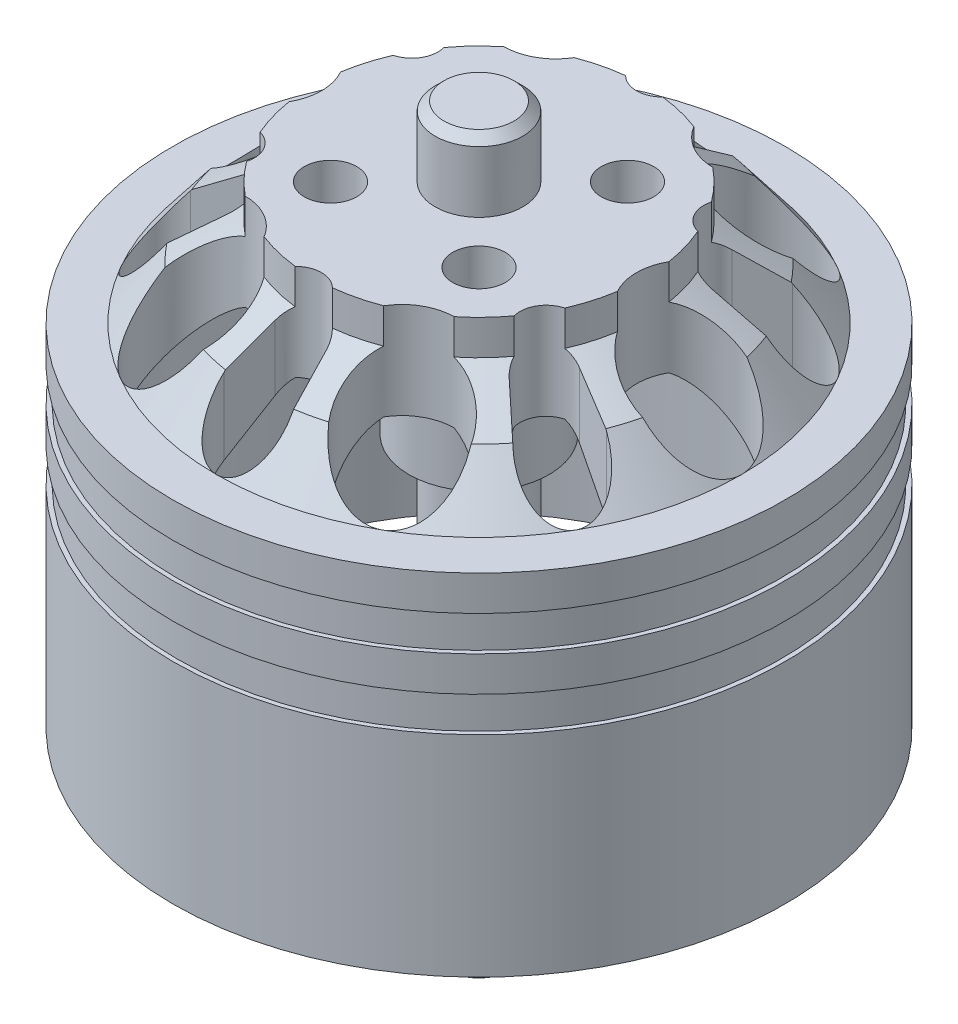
from build123d import *

# Parameters (mm, degrees)
SKETCH3_R          = 3
CUT_EXTRUDE1_DEPTH = 46.348649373
CIRPATTERN1_COUNT  = 6
CUT_EXTRUDE2_DEPTH = 46.348649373
CIRPATTERN2_COUNT  = 6
CHAMFER1_SIZE      = 0.5
SKETCH5_R          = 1.5
CUT_EXTRUDE3_DEPTH = 10


with BuildPart() as part:
    # Sketch1 → Revolve1 (revolve)
    with BuildSketch(Plane.XY, mode=Mode.PRIVATE) as revolve1_sk:
        Polygon((0, 0), (0, 42), (2.5, 42), (2.5, 38), (9.5, 38), (9.5, 36), (12.690817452, 33.984899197), (15, 31), (17.5, 31), (17.5, 29), (17.25, 29), (17.25, 27), (17.5, 27), (17.5, 25), (17.25, 25), (17.25, 23), (17.5, 23), (17.5, 11), (15, 11), (15, 28.5), (13.9, 28.5), (9.5, 32.5), (4, 32.5), (4, 25.5), (2.5, 25.5), (2.5, 0), align=None)
    revolve(revolve1_sk.sketch.rotate(Axis((0, 0, 0), (0, -1, 0)), 90), axis=Axis((0, 0, 0), (0, -1, 0)))

    # Sketch3 → Cut-Extrude1 (cut, through all)
    with BuildSketch(Plane(origin=(0, 38, 0), x_dir=(1, 0, 0), z_dir=(0, 1, 0))):
        with Locations(Location((12, 0, 0), (0, 0, 209.363334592))):
            Circle(SKETCH3_R)
    cut_extrude1 = extrude(amount=-CUT_EXTRUDE1_DEPTH, mode=Mode.SUBTRACT)

    # CirPattern1: Cut-Extrude1 ×6 about axis
    cirpattern1_axis = Axis((0, 0, 0), (0, 1, 0))
    for i in range(1, CIRPATTERN1_COUNT):
        add(cut_extrude1.rotate(cirpattern1_axis, i * 360 / CIRPATTERN1_COUNT), mode=Mode.SUBTRACT)

    # Sketch4 → Cut-Extrude2 (cut, through all)
    with BuildSketch(Plane(origin=(0, 38, 0), x_dir=(1, 0, 0), z_dir=(0, 1, 0))):
        with BuildLine():
            ThreePointArc((11.891715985, 4.602943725), (12.990381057, 7.5), (9.932124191, 7.997056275))
            Line((9.932124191, 7.997056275), (8.098612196, 6.372792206))
            ThreePointArc((8.098612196, 6.372792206), (7.794228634, 4.5), (9.568306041, 3.827207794))
            Line((9.568306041, 3.827207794), (11.891715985, 4.602943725))
        make_face()
    cut_extrude2 = extrude(amount=-CUT_EXTRUDE2_DEPTH, mode=Mode.SUBTRACT)

    # CirPattern2: Cut-Extrude2 ×6 about axis
    cirpattern2_axis = Axis((0, 0, 0), (0, 1, 0))
    for i in range(1, CIRPATTERN2_COUNT):
        add(cut_extrude2.rotate(cirpattern2_axis, i * 360 / CIRPATTERN2_COUNT), mode=Mode.SUBTRACT)

    # Chamfer1
    chamfer1_edges = [part.edges().sort_by_distance(p)[0] for p in [
        (0, 0, -2.5),
        (0, 42, -2.5),
    ]]
    chamfer(chamfer1_edges, length=CHAMFER1_SIZE)

    # Sketch5 → Cut-Extrude3 (cut)
    with BuildSketch(Plane(origin=(0, 38, 0), x_dir=(1, 0, 0), z_dir=(0, 1, 0))):
        with Locations(Location((-4.242640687, 4.242640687, 0), (0, 0, 270))):
            Circle(SKETCH5_R)
        with Locations(Location((-4.242640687, -4.242640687, 0), (0, 0, 270))):
            Circle(SKETCH5_R)
        with Locations(Location((4.242640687, -4.242640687, 0), (0, 0, 270))):
            Circle(SKETCH5_R)
        with Locations(Location((4.242640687, 4.242640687, 0), (0, 0, 270))):
            Circle(SKETCH5_R)
    extrude(amount=-CUT_EXTRUDE3_DEPTH, mode=Mode.SUBTRACT)


solid = part.part
